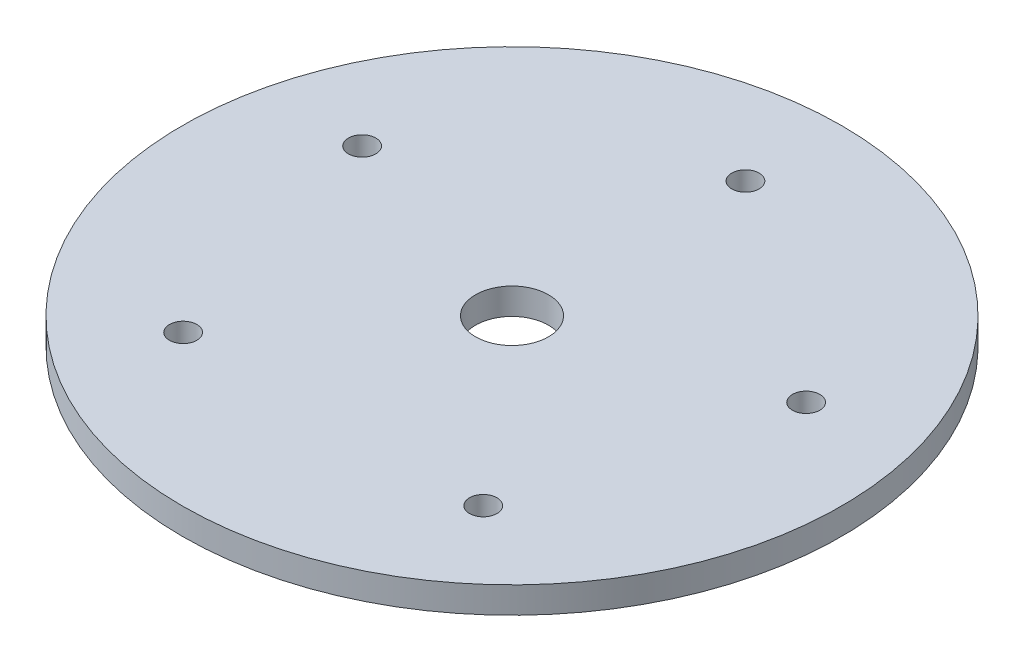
from build123d import *

# Parameters (mm, degrees)
SKETCH1_R                 = 38.1
SKETCH1_R_2               = 1.5875
BOSS_EXTRUDE1_DEPTH       = 3.048
F_1_8_NPT_HOLE_DEPTH      = 54.967678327
F_1_8_NPT_HOLE_DEPTH_BACK = 54.967678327
SKETCH2_R                 = 4.2164


with BuildPart() as part:
    # Sketch1 → Boss-Extrude1 (new body)
    with BuildSketch(Plane(origin=(0, 0, 0), x_dir=(1, 0, 0), z_dir=(0, 1, 0))):
        with Locations(Location((0, 0, 0), (0, 0, 90))):
            Circle(SKETCH1_R)
        with Locations(Location((0, 26.9875, 0), (0, 0, 90))):
            Circle(SKETCH1_R_2, mode=Mode.SUBTRACT)
        with Locations(Location((25.666637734, 8.339596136, 0), (0, 0, 90))):
            Circle(SKETCH1_R_2, mode=Mode.SUBTRACT)
        with Locations(Location((17.347230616, -20.673624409, 0), (0, 0, 90))):
            Circle(SKETCH1_R_2, mode=Mode.SUBTRACT)
        with Locations(Location((-17.347230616, -20.673624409, 0), (0, 0, 90))):
            Circle(SKETCH1_R_2, mode=Mode.SUBTRACT)
        with Locations(Location((-25.666637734, 8.339596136, 0), (0, 0, 90))):
            Circle(SKETCH1_R_2, mode=Mode.SUBTRACT)
    extrude(amount=BOSS_EXTRUDE1_DEPTH)

    # Sketch2 → 1_8 NPT hole (cut, two sides: drawn at the far end of the back side and taken through both)
    with BuildSketch(Plane(origin=(0, 3.048, 0), x_dir=(1, 0, 0), z_dir=(0, 1, 0)).offset(-F_1_8_NPT_HOLE_DEPTH_BACK)):
        with Locations(Location((0, 0, 0), (0, 0, 270))):
            Circle(SKETCH2_R)
    extrude(amount=F_1_8_NPT_HOLE_DEPTH + F_1_8_NPT_HOLE_DEPTH_BACK, mode=Mode.SUBTRACT)


solid = part.part
